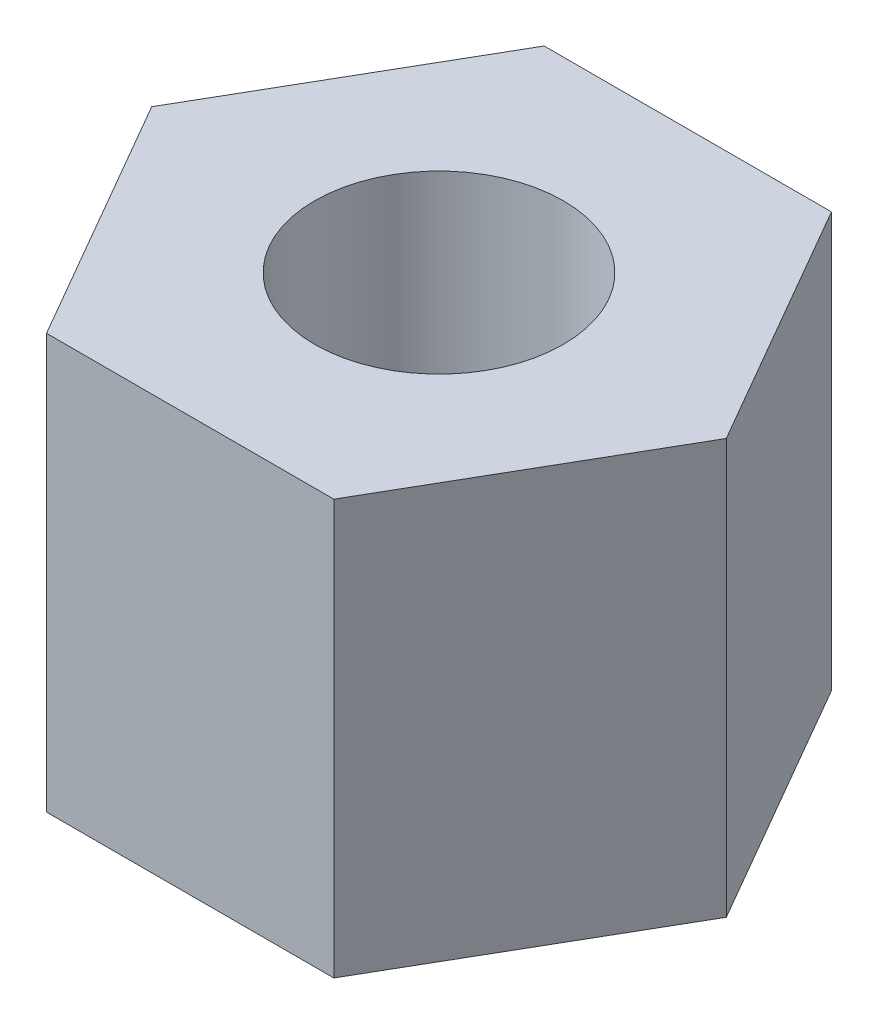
ISO-10303-21;
HEADER;
FILE_DESCRIPTION(('STEP AP214'),'2;1');
FILE_NAME('part.step','',(''),(''),'','','');
FILE_SCHEMA(('AUTOMOTIVE_DESIGN { 1 0 10303 214 1 1 1 1 }'));
ENDSEC;
DATA;
#1=APPLICATION_CONTEXT('core data for automotive mechanical design processes');
#2=APPLICATION_PROTOCOL_DEFINITION('international standard','automotive_design',2000,#1);
#3=PRODUCT_CONTEXT('',#1,'mechanical');
#4=PRODUCT('Part','Part','',(#3));
#5=PRODUCT_RELATED_PRODUCT_CATEGORY('part','',(#4));
#6=PRODUCT_DEFINITION_FORMATION('','',#4);
#7=PRODUCT_DEFINITION_CONTEXT('part definition',#1,'design');
#8=PRODUCT_DEFINITION('design','',#6,#7);
#9=PRODUCT_DEFINITION_SHAPE('','',#8);
#10=(LENGTH_UNIT() NAMED_UNIT(*) SI_UNIT(.MILLI.,.METRE.));
#11=(NAMED_UNIT(*) PLANE_ANGLE_UNIT() SI_UNIT($,.RADIAN.));
#12=(NAMED_UNIT(*) SI_UNIT($,.STERADIAN.) SOLID_ANGLE_UNIT());
#13=UNCERTAINTY_MEASURE_WITH_UNIT(LENGTH_MEASURE(1.E-05),#10,'distance_accuracy_value','');
#14=(GEOMETRIC_REPRESENTATION_CONTEXT(3) GLOBAL_UNCERTAINTY_ASSIGNED_CONTEXT((#13)) GLOBAL_UNIT_ASSIGNED_CONTEXT((#10,
#11,#12)) REPRESENTATION_CONTEXT('',''));
#15=CARTESIAN_POINT('',(0.,0.,0.));
#16=DIRECTION('',(0.,0.,1.));
#17=DIRECTION('',(1.,0.,0.));
#18=AXIS2_PLACEMENT_3D('',#15,#16,#17);
#19=CARTESIAN_POINT('',(0.,5.,0.));
#20=DIRECTION('',(0.,1.,0.));
#21=DIRECTION('',(0.,0.,1.));
#22=AXIS2_PLACEMENT_3D('',#19,#20,#21);
#23=PLANE('',#22);
#24=DIRECTION('',(0.5,0.,-0.866025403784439));
#25=VECTOR('',#24,1.);
#26=CARTESIAN_POINT('',(1.73205080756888,5.,3.));
#27=LINE('',#26,#25);
#28=CARTESIAN_POINT('',(1.73205080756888,5.,3.));
#29=VERTEX_POINT('',#28);
#30=CARTESIAN_POINT('',(3.46410161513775,5.,0.));
#31=VERTEX_POINT('',#30);
#32=EDGE_CURVE('E129',#29,#31,#27,.T.);
#33=ORIENTED_EDGE('',*,*,#32,.T.);
#34=DIRECTION('',(-0.5,0.,-0.866025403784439));
#35=VECTOR('',#34,1.);
#36=CARTESIAN_POINT('',(3.46410161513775,5.,0.));
#37=LINE('',#36,#35);
#38=CARTESIAN_POINT('',(1.73205080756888,5.,-3.));
#39=VERTEX_POINT('',#38);
#40=EDGE_CURVE('E87',#31,#39,#37,.T.);
#41=ORIENTED_EDGE('',*,*,#40,.T.);
#42=DIRECTION('',(-1.,0.,0.));
#43=VECTOR('',#42,1.);
#44=CARTESIAN_POINT('',(1.73205080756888,5.,-3.));
#45=LINE('',#44,#43);
#46=CARTESIAN_POINT('',(-1.73205080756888,5.,-3.));
#47=VERTEX_POINT('',#46);
#48=EDGE_CURVE('E100',#39,#47,#45,.T.);
#49=ORIENTED_EDGE('',*,*,#48,.T.);
#50=DIRECTION('',(-0.5,0.,0.866025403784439));
#51=VECTOR('',#50,1.);
#52=CARTESIAN_POINT('',(-1.73205080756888,5.,-3.));
#53=LINE('',#52,#51);
#54=CARTESIAN_POINT('',(-3.46410161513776,5.,0.));
#55=VERTEX_POINT('',#54);
#56=EDGE_CURVE('E94',#47,#55,#53,.T.);
#57=ORIENTED_EDGE('',*,*,#56,.T.);
#58=DIRECTION('',(0.5,0.,0.866025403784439));
#59=VECTOR('',#58,1.);
#60=CARTESIAN_POINT('',(-3.46410161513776,5.,0.));
#61=LINE('',#60,#59);
#62=CARTESIAN_POINT('',(-1.73205080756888,5.,3.));
#63=VERTEX_POINT('',#62);
#64=EDGE_CURVE('E98',#55,#63,#61,.T.);
#65=ORIENTED_EDGE('',*,*,#64,.T.);
#66=DIRECTION('',(1.,0.,0.));
#67=VECTOR('',#66,1.);
#68=CARTESIAN_POINT('',(-1.73205080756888,5.,3.));
#69=LINE('',#68,#67);
#70=EDGE_CURVE('E50',#63,#29,#69,.T.);
#71=ORIENTED_EDGE('',*,*,#70,.T.);
#72=EDGE_LOOP('',(#33,#41,#49,#57,#65,#71));
#73=FACE_BOUND('',#72,.T.);
#74=CARTESIAN_POINT('',(0.,5.,0.));
#75=DIRECTION('',(0.,1.,0.));
#76=DIRECTION('',(0.,0.,1.));
#77=AXIS2_PLACEMENT_3D('',#74,#75,#76);
#78=CIRCLE('',#77,1.5);
#79=CARTESIAN_POINT('',(0.,5.,1.5));
#80=VERTEX_POINT('',#79);
#81=EDGE_CURVE('E122',#80,#80,#78,.T.);
#82=ORIENTED_EDGE('',*,*,#81,.F.);
#83=EDGE_LOOP('',(#82));
#84=FACE_BOUND('',#83,.T.);
#85=ADVANCED_FACE('F33',(#73,#84),#23,.T.);
#86=CARTESIAN_POINT('',(0.,0.,0.));
#87=DIRECTION('',(0.,1.,0.));
#88=DIRECTION('',(0.,0.,1.));
#89=AXIS2_PLACEMENT_3D('',#86,#87,#88);
#90=PLANE('',#89);
#91=DIRECTION('',(0.5,0.,-0.866025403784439));
#92=VECTOR('',#91,1.);
#93=CARTESIAN_POINT('',(1.73205080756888,0.,3.));
#94=LINE('',#93,#92);
#95=CARTESIAN_POINT('',(1.73205080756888,0.,3.));
#96=VERTEX_POINT('',#95);
#97=CARTESIAN_POINT('',(3.46410161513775,0.,0.));
#98=VERTEX_POINT('',#97);
#99=EDGE_CURVE('E118',#96,#98,#94,.T.);
#100=ORIENTED_EDGE('',*,*,#99,.F.);
#101=DIRECTION('',(1.,0.,0.));
#102=VECTOR('',#101,1.);
#103=CARTESIAN_POINT('',(-1.73205080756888,0.,3.));
#104=LINE('',#103,#102);
#105=CARTESIAN_POINT('',(-1.73205080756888,0.,3.));
#106=VERTEX_POINT('',#105);
#107=EDGE_CURVE('E79',#106,#96,#104,.T.);
#108=ORIENTED_EDGE('',*,*,#107,.F.);
#109=DIRECTION('',(0.5,0.,0.866025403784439));
#110=VECTOR('',#109,1.);
#111=CARTESIAN_POINT('',(-3.46410161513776,0.,0.));
#112=LINE('',#111,#110);
#113=CARTESIAN_POINT('',(-3.46410161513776,0.,0.));
#114=VERTEX_POINT('',#113);
#115=EDGE_CURVE('E73',#114,#106,#112,.T.);
#116=ORIENTED_EDGE('',*,*,#115,.F.);
#117=DIRECTION('',(-0.5,0.,0.866025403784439));
#118=VECTOR('',#117,1.);
#119=CARTESIAN_POINT('',(-1.73205080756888,0.,-3.));
#120=LINE('',#119,#118);
#121=CARTESIAN_POINT('',(-1.73205080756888,0.,-3.));
#122=VERTEX_POINT('',#121);
#123=EDGE_CURVE('E108',#122,#114,#120,.T.);
#124=ORIENTED_EDGE('',*,*,#123,.F.);
#125=DIRECTION('',(-1.,0.,0.));
#126=VECTOR('',#125,1.);
#127=CARTESIAN_POINT('',(1.73205080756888,0.,-3.));
#128=LINE('',#127,#126);
#129=CARTESIAN_POINT('',(1.73205080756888,0.,-3.));
#130=VERTEX_POINT('',#129);
#131=EDGE_CURVE('E124',#130,#122,#128,.T.);
#132=ORIENTED_EDGE('',*,*,#131,.F.);
#133=DIRECTION('',(-0.5,0.,-0.866025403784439));
#134=VECTOR('',#133,1.);
#135=CARTESIAN_POINT('',(3.46410161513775,0.,0.));
#136=LINE('',#135,#134);
#137=EDGE_CURVE('E121',#98,#130,#136,.T.);
#138=ORIENTED_EDGE('',*,*,#137,.F.);
#139=EDGE_LOOP('',(#100,#108,#116,#124,#132,#138));
#140=FACE_BOUND('',#139,.T.);
#141=CARTESIAN_POINT('',(0.,0.,0.));
#142=DIRECTION('',(0.,1.,0.));
#143=DIRECTION('',(0.,0.,1.));
#144=AXIS2_PLACEMENT_3D('',#141,#142,#143);
#145=CIRCLE('',#144,1.5);
#146=CARTESIAN_POINT('',(0.,0.,1.5));
#147=VERTEX_POINT('',#146);
#148=EDGE_CURVE('E222',#147,#147,#145,.T.);
#149=ORIENTED_EDGE('',*,*,#148,.T.);
#150=EDGE_LOOP('',(#149));
#151=FACE_BOUND('',#150,.T.);
#152=ADVANCED_FACE('F138',(#140,#151),#90,.F.);
#153=CARTESIAN_POINT('',(1.73205080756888,5.,3.));
#154=DIRECTION('',(-0.866025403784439,0.,-0.5));
#155=DIRECTION('',(-0.5,0.,0.866025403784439));
#156=AXIS2_PLACEMENT_3D('',#153,#154,#155);
#157=PLANE('',#156);
#158=ORIENTED_EDGE('',*,*,#99,.T.);
#159=DIRECTION('',(0.,-1.,0.));
#160=VECTOR('',#159,1.);
#161=CARTESIAN_POINT('',(3.46410161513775,5.,0.));
#162=LINE('',#161,#160);
#163=EDGE_CURVE('E11',#31,#98,#162,.T.);
#164=ORIENTED_EDGE('',*,*,#163,.F.);
#165=ORIENTED_EDGE('',*,*,#32,.F.);
#166=DIRECTION('',(0.,-1.,0.));
#167=VECTOR('',#166,1.);
#168=CARTESIAN_POINT('',(1.73205080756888,5.,3.));
#169=LINE('',#168,#167);
#170=EDGE_CURVE('E114',#29,#96,#169,.T.);
#171=ORIENTED_EDGE('',*,*,#170,.T.);
#172=EDGE_LOOP('',(#158,#164,#165,#171));
#173=FACE_BOUND('',#172,.T.);
#174=ADVANCED_FACE('F35',(#173),#157,.F.);
#175=CARTESIAN_POINT('',(3.46410161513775,5.,0.));
#176=DIRECTION('',(-0.866025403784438,0.,0.5));
#177=DIRECTION('',(0.5,0.,0.866025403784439));
#178=AXIS2_PLACEMENT_3D('',#175,#176,#177);
#179=PLANE('',#178);
#180=ORIENTED_EDGE('',*,*,#137,.T.);
#181=DIRECTION('',(0.,-1.,0.));
#182=VECTOR('',#181,1.);
#183=CARTESIAN_POINT('',(1.73205080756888,5.,-3.));
#184=LINE('',#183,#182);
#185=EDGE_CURVE('E42',#39,#130,#184,.T.);
#186=ORIENTED_EDGE('',*,*,#185,.F.);
#187=ORIENTED_EDGE('',*,*,#40,.F.);
#188=ORIENTED_EDGE('',*,*,#163,.T.);
#189=EDGE_LOOP('',(#180,#186,#187,#188));
#190=FACE_BOUND('',#189,.T.);
#191=ADVANCED_FACE('F163',(#190),#179,.F.);
#192=CARTESIAN_POINT('',(1.73205080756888,5.,-3.));
#193=DIRECTION('',(0.,0.,1.));
#194=DIRECTION('',(1.,0.,0.));
#195=AXIS2_PLACEMENT_3D('',#192,#193,#194);
#196=PLANE('',#195);
#197=ORIENTED_EDGE('',*,*,#131,.T.);
#198=DIRECTION('',(0.,-1.,0.));
#199=VECTOR('',#198,1.);
#200=CARTESIAN_POINT('',(-1.73205080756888,5.,-3.));
#201=LINE('',#200,#199);
#202=EDGE_CURVE('E109',#47,#122,#201,.T.);
#203=ORIENTED_EDGE('',*,*,#202,.F.);
#204=ORIENTED_EDGE('',*,*,#48,.F.);
#205=ORIENTED_EDGE('',*,*,#185,.T.);
#206=EDGE_LOOP('',(#197,#203,#204,#205));
#207=FACE_BOUND('',#206,.T.);
#208=ADVANCED_FACE('F135',(#207),#196,.F.);
#209=CARTESIAN_POINT('',(-1.73205080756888,5.,-3.));
#210=DIRECTION('',(0.866025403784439,0.,0.5));
#211=DIRECTION('',(0.5,0.,-0.866025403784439));
#212=AXIS2_PLACEMENT_3D('',#209,#210,#211);
#213=PLANE('',#212);
#214=ORIENTED_EDGE('',*,*,#123,.T.);
#215=DIRECTION('',(0.,-1.,0.));
#216=VECTOR('',#215,1.);
#217=CARTESIAN_POINT('',(-3.46410161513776,5.,0.));
#218=LINE('',#217,#216);
#219=EDGE_CURVE('E105',#55,#114,#218,.T.);
#220=ORIENTED_EDGE('',*,*,#219,.F.);
#221=ORIENTED_EDGE('',*,*,#56,.F.);
#222=ORIENTED_EDGE('',*,*,#202,.T.);
#223=EDGE_LOOP('',(#214,#220,#221,#222));
#224=FACE_BOUND('',#223,.T.);
#225=ADVANCED_FACE('F106',(#224),#213,.F.);
#226=CARTESIAN_POINT('',(-3.46410161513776,5.,0.));
#227=DIRECTION('',(0.866025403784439,0.,-0.5));
#228=DIRECTION('',(-0.5,0.,-0.866025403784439));
#229=AXIS2_PLACEMENT_3D('',#226,#227,#228);
#230=PLANE('',#229);
#231=ORIENTED_EDGE('',*,*,#115,.T.);
#232=DIRECTION('',(0.,-1.,0.));
#233=VECTOR('',#232,1.);
#234=CARTESIAN_POINT('',(-1.73205080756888,5.,3.));
#235=LINE('',#234,#233);
#236=EDGE_CURVE('E110',#63,#106,#235,.T.);
#237=ORIENTED_EDGE('',*,*,#236,.F.);
#238=ORIENTED_EDGE('',*,*,#64,.F.);
#239=ORIENTED_EDGE('',*,*,#219,.T.);
#240=EDGE_LOOP('',(#231,#237,#238,#239));
#241=FACE_BOUND('',#240,.T.);
#242=ADVANCED_FACE('F112',(#241),#230,.F.);
#243=CARTESIAN_POINT('',(-1.73205080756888,5.,3.));
#244=DIRECTION('',(0.,0.,-1.));
#245=DIRECTION('',(-1.,0.,0.));
#246=AXIS2_PLACEMENT_3D('',#243,#244,#245);
#247=PLANE('',#246);
#248=ORIENTED_EDGE('',*,*,#107,.T.);
#249=ORIENTED_EDGE('',*,*,#170,.F.);
#250=ORIENTED_EDGE('',*,*,#70,.F.);
#251=ORIENTED_EDGE('',*,*,#236,.T.);
#252=EDGE_LOOP('',(#248,#249,#250,#251));
#253=FACE_BOUND('',#252,.T.);
#254=ADVANCED_FACE('F143',(#253),#247,.F.);
#255=CARTESIAN_POINT('',(0.,5.,0.));
#256=DIRECTION('',(0.,-1.,0.));
#257=DIRECTION('',(0.,0.,-1.));
#258=AXIS2_PLACEMENT_3D('',#255,#256,#257);
#259=CYLINDRICAL_SURFACE('',#258,1.5);
#260=ORIENTED_EDGE('',*,*,#81,.T.);
#261=EDGE_LOOP('',(#260));
#262=FACE_BOUND('',#261,.T.);
#263=ORIENTED_EDGE('',*,*,#148,.F.);
#264=EDGE_LOOP('',(#263));
#265=FACE_BOUND('',#264,.T.);
#266=ADVANCED_FACE('F145',(#262,#265),#259,.F.);
#267=CLOSED_SHELL('',(#85,#152,#174,#191,#208,#225,#242,#254,#266));
#268=MANIFOLD_SOLID_BREP('B2',#267);
#269=ADVANCED_BREP_SHAPE_REPRESENTATION('',(#18,#268),#14);
#270=SHAPE_DEFINITION_REPRESENTATION(#9,#269);
ENDSEC;
END-ISO-10303-21;
